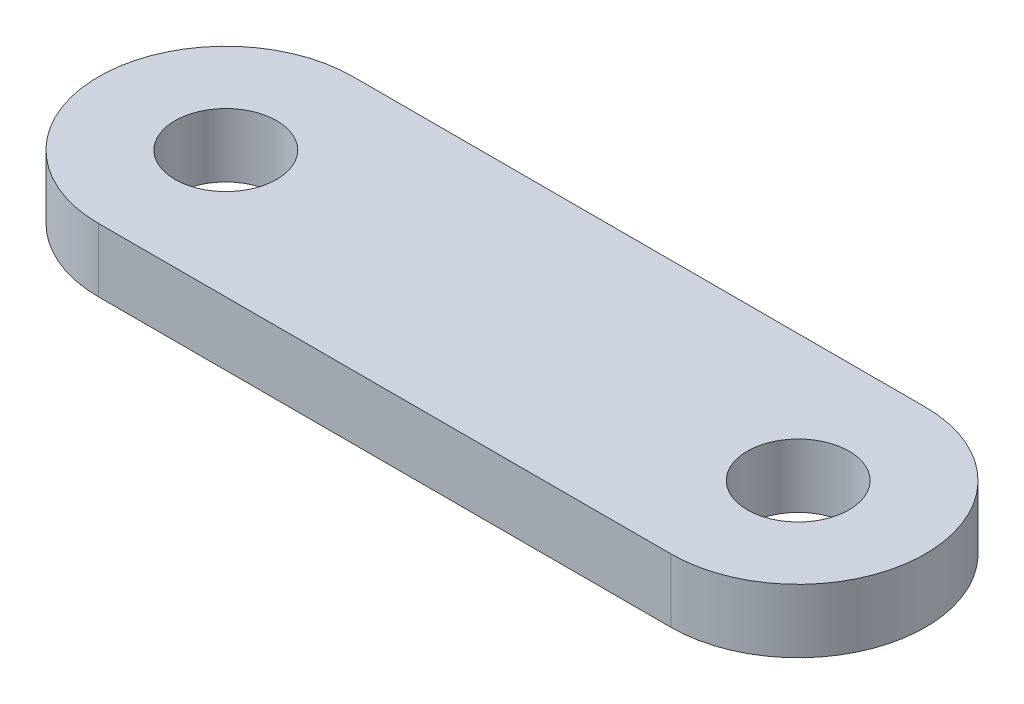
ISO-10303-21;
HEADER;
FILE_DESCRIPTION(('STEP AP214'),'2;1');
FILE_NAME('part.step','',(''),(''),'','','');
FILE_SCHEMA(('AUTOMOTIVE_DESIGN { 1 0 10303 214 1 1 1 1 }'));
ENDSEC;
DATA;
#1=APPLICATION_CONTEXT('core data for automotive mechanical design processes');
#2=APPLICATION_PROTOCOL_DEFINITION('international standard','automotive_design',2000,#1);
#3=PRODUCT_CONTEXT('',#1,'mechanical');
#4=PRODUCT('Part','Part','',(#3));
#5=PRODUCT_RELATED_PRODUCT_CATEGORY('part','',(#4));
#6=PRODUCT_DEFINITION_FORMATION('','',#4);
#7=PRODUCT_DEFINITION_CONTEXT('part definition',#1,'design');
#8=PRODUCT_DEFINITION('design','',#6,#7);
#9=PRODUCT_DEFINITION_SHAPE('','',#8);
#10=(LENGTH_UNIT() NAMED_UNIT(*) SI_UNIT(.MILLI.,.METRE.));
#11=(NAMED_UNIT(*) PLANE_ANGLE_UNIT() SI_UNIT($,.RADIAN.));
#12=(NAMED_UNIT(*) SI_UNIT($,.STERADIAN.) SOLID_ANGLE_UNIT());
#13=UNCERTAINTY_MEASURE_WITH_UNIT(LENGTH_MEASURE(1.E-05),#10,'distance_accuracy_value','');
#14=(GEOMETRIC_REPRESENTATION_CONTEXT(3) GLOBAL_UNCERTAINTY_ASSIGNED_CONTEXT((#13)) GLOBAL_UNIT_ASSIGNED_CONTEXT((#10,
#11,#12)) REPRESENTATION_CONTEXT('',''));
#15=CARTESIAN_POINT('',(0.,0.,0.));
#16=DIRECTION('',(0.,0.,1.));
#17=DIRECTION('',(1.,0.,0.));
#18=AXIS2_PLACEMENT_3D('',#15,#16,#17);
#19=CARTESIAN_POINT('',(0.,2.,4.));
#20=DIRECTION('',(0.,1.,0.));
#21=DIRECTION('',(0.,0.,1.));
#22=AXIS2_PLACEMENT_3D('',#19,#20,#21);
#23=PLANE('',#22);
#24=CARTESIAN_POINT('',(0.,2.,4.));
#25=DIRECTION('',(0.,1.,0.));
#26=DIRECTION('',(0.,0.,1.));
#27=AXIS2_PLACEMENT_3D('',#24,#25,#26);
#28=CIRCLE('',#27,1.6);
#29=CARTESIAN_POINT('',(0.,2.,5.6));
#30=VERTEX_POINT('',#29);
#31=EDGE_CURVE('E101',#30,#30,#28,.T.);
#32=ORIENTED_EDGE('',*,*,#31,.F.);
#33=EDGE_LOOP('',(#32));
#34=FACE_BOUND('',#33,.T.);
#35=CARTESIAN_POINT('',(0.,2.,4.));
#36=DIRECTION('',(0.,1.,0.));
#37=DIRECTION('',(0.,0.,1.));
#38=AXIS2_PLACEMENT_3D('',#35,#36,#37);
#39=CIRCLE('',#38,4.);
#40=CARTESIAN_POINT('',(0.,2.,0.));
#41=VERTEX_POINT('',#40);
#42=CARTESIAN_POINT('',(0.,2.,8.));
#43=VERTEX_POINT('',#42);
#44=EDGE_CURVE('E86',#41,#43,#39,.T.);
#45=ORIENTED_EDGE('',*,*,#44,.T.);
#46=DIRECTION('',(1.,0.,0.));
#47=VECTOR('',#46,1.);
#48=CARTESIAN_POINT('',(0.,2.,8.));
#49=LINE('',#48,#47);
#50=CARTESIAN_POINT('',(18.,2.,8.));
#51=VERTEX_POINT('',#50);
#52=EDGE_CURVE('E81',#43,#51,#49,.T.);
#53=ORIENTED_EDGE('',*,*,#52,.T.);
#54=CARTESIAN_POINT('',(18.,2.,4.));
#55=DIRECTION('',(0.,1.,0.));
#56=DIRECTION('',(0.,0.,-1.));
#57=AXIS2_PLACEMENT_3D('',#54,#55,#56);
#58=CIRCLE('',#57,4.);
#59=CARTESIAN_POINT('',(18.,2.,0.));
#60=VERTEX_POINT('',#59);
#61=EDGE_CURVE('E84',#51,#60,#58,.T.);
#62=ORIENTED_EDGE('',*,*,#61,.T.);
#63=DIRECTION('',(-1.,0.,0.));
#64=VECTOR('',#63,1.);
#65=CARTESIAN_POINT('',(0.,2.,0.));
#66=LINE('',#65,#64);
#67=EDGE_CURVE('E51',#60,#41,#66,.T.);
#68=ORIENTED_EDGE('',*,*,#67,.T.);
#69=EDGE_LOOP('',(#45,#53,#62,#68));
#70=FACE_BOUND('',#69,.T.);
#71=CARTESIAN_POINT('',(18.,2.,4.));
#72=DIRECTION('',(0.,1.,0.));
#73=DIRECTION('',(0.,0.,1.));
#74=AXIS2_PLACEMENT_3D('',#71,#72,#73);
#75=CIRCLE('',#74,1.6);
#76=CARTESIAN_POINT('',(18.,2.,5.6));
#77=VERTEX_POINT('',#76);
#78=EDGE_CURVE('E116',#77,#77,#75,.T.);
#79=ORIENTED_EDGE('',*,*,#78,.F.);
#80=EDGE_LOOP('',(#79));
#81=FACE_BOUND('',#80,.T.);
#82=ADVANCED_FACE('F34',(#34,#70,#81),#23,.T.);
#83=CARTESIAN_POINT('',(0.,0.,4.));
#84=DIRECTION('',(0.,1.,0.));
#85=DIRECTION('',(0.,0.,1.));
#86=AXIS2_PLACEMENT_3D('',#83,#84,#85);
#87=PLANE('',#86);
#88=CARTESIAN_POINT('',(0.,0.,4.));
#89=DIRECTION('',(0.,1.,0.));
#90=DIRECTION('',(0.,0.,1.));
#91=AXIS2_PLACEMENT_3D('',#88,#89,#90);
#92=CIRCLE('',#91,4.);
#93=CARTESIAN_POINT('',(0.,0.,0.));
#94=VERTEX_POINT('',#93);
#95=CARTESIAN_POINT('',(0.,0.,8.));
#96=VERTEX_POINT('',#95);
#97=EDGE_CURVE('E98',#94,#96,#92,.T.);
#98=ORIENTED_EDGE('',*,*,#97,.F.);
#99=DIRECTION('',(-1.,0.,0.));
#100=VECTOR('',#99,1.);
#101=CARTESIAN_POINT('',(0.,0.,0.));
#102=LINE('',#101,#100);
#103=CARTESIAN_POINT('',(18.,0.,0.));
#104=VERTEX_POINT('',#103);
#105=EDGE_CURVE('E74',#104,#94,#102,.T.);
#106=ORIENTED_EDGE('',*,*,#105,.F.);
#107=CARTESIAN_POINT('',(18.,0.,4.));
#108=DIRECTION('',(0.,1.,0.));
#109=DIRECTION('',(0.,0.,-1.));
#110=AXIS2_PLACEMENT_3D('',#107,#108,#109);
#111=CIRCLE('',#110,4.);
#112=CARTESIAN_POINT('',(18.,0.,8.));
#113=VERTEX_POINT('',#112);
#114=EDGE_CURVE('E68',#113,#104,#111,.T.);
#115=ORIENTED_EDGE('',*,*,#114,.F.);
#116=DIRECTION('',(1.,0.,0.));
#117=VECTOR('',#116,1.);
#118=CARTESIAN_POINT('',(0.,0.,8.));
#119=LINE('',#118,#117);
#120=EDGE_CURVE('E90',#96,#113,#119,.T.);
#121=ORIENTED_EDGE('',*,*,#120,.F.);
#122=EDGE_LOOP('',(#98,#106,#115,#121));
#123=FACE_BOUND('',#122,.T.);
#124=CARTESIAN_POINT('',(0.,0.,4.));
#125=DIRECTION('',(0.,1.,0.));
#126=DIRECTION('',(0.,0.,1.));
#127=AXIS2_PLACEMENT_3D('',#124,#125,#126);
#128=CIRCLE('',#127,1.6);
#129=CARTESIAN_POINT('',(0.,0.,5.6));
#130=VERTEX_POINT('',#129);
#131=EDGE_CURVE('E113',#130,#130,#128,.T.);
#132=ORIENTED_EDGE('',*,*,#131,.T.);
#133=EDGE_LOOP('',(#132));
#134=FACE_BOUND('',#133,.T.);
#135=CARTESIAN_POINT('',(18.,0.,4.));
#136=DIRECTION('',(0.,1.,0.));
#137=DIRECTION('',(0.,0.,1.));
#138=AXIS2_PLACEMENT_3D('',#135,#136,#137);
#139=CIRCLE('',#138,1.6);
#140=CARTESIAN_POINT('',(18.,0.,5.6));
#141=VERTEX_POINT('',#140);
#142=EDGE_CURVE('E119',#141,#141,#139,.T.);
#143=ORIENTED_EDGE('',*,*,#142,.T.);
#144=EDGE_LOOP('',(#143));
#145=FACE_BOUND('',#144,.T.);
#146=ADVANCED_FACE('F109',(#123,#134,#145),#87,.F.);
#147=CARTESIAN_POINT('',(0.,2.,4.));
#148=DIRECTION('',(0.,-1.,0.));
#149=DIRECTION('',(0.,0.,-1.));
#150=AXIS2_PLACEMENT_3D('',#147,#148,#149);
#151=CYLINDRICAL_SURFACE('',#150,4.);
#152=ORIENTED_EDGE('',*,*,#97,.T.);
#153=DIRECTION('',(0.,-1.,0.));
#154=VECTOR('',#153,1.);
#155=CARTESIAN_POINT('',(0.,2.,8.));
#156=LINE('',#155,#154);
#157=EDGE_CURVE('E11',#43,#96,#156,.T.);
#158=ORIENTED_EDGE('',*,*,#157,.F.);
#159=ORIENTED_EDGE('',*,*,#44,.F.);
#160=DIRECTION('',(0.,-1.,0.));
#161=VECTOR('',#160,1.);
#162=CARTESIAN_POINT('',(0.,2.,0.));
#163=LINE('',#162,#161);
#164=EDGE_CURVE('E94',#41,#94,#163,.T.);
#165=ORIENTED_EDGE('',*,*,#164,.T.);
#166=EDGE_LOOP('',(#152,#158,#159,#165));
#167=FACE_BOUND('',#166,.T.);
#168=ADVANCED_FACE('F36',(#167),#151,.T.);
#169=CARTESIAN_POINT('',(0.,2.,8.));
#170=DIRECTION('',(0.,0.,-1.));
#171=DIRECTION('',(-1.,0.,0.));
#172=AXIS2_PLACEMENT_3D('',#169,#170,#171);
#173=PLANE('',#172);
#174=ORIENTED_EDGE('',*,*,#120,.T.);
#175=DIRECTION('',(0.,-1.,0.));
#176=VECTOR('',#175,1.);
#177=CARTESIAN_POINT('',(18.,2.,8.));
#178=LINE('',#177,#176);
#179=EDGE_CURVE('E43',#51,#113,#178,.T.);
#180=ORIENTED_EDGE('',*,*,#179,.F.);
#181=ORIENTED_EDGE('',*,*,#52,.F.);
#182=ORIENTED_EDGE('',*,*,#157,.T.);
#183=EDGE_LOOP('',(#174,#180,#181,#182));
#184=FACE_BOUND('',#183,.T.);
#185=ADVANCED_FACE('F89',(#184),#173,.F.);
#186=CARTESIAN_POINT('',(18.,2.,4.));
#187=DIRECTION('',(0.,-1.,0.));
#188=DIRECTION('',(0.,0.,-1.));
#189=AXIS2_PLACEMENT_3D('',#186,#187,#188);
#190=CYLINDRICAL_SURFACE('',#189,4.);
#191=ORIENTED_EDGE('',*,*,#114,.T.);
#192=DIRECTION('',(0.,-1.,0.));
#193=VECTOR('',#192,1.);
#194=CARTESIAN_POINT('',(18.,2.,0.));
#195=LINE('',#194,#193);
#196=EDGE_CURVE('E91',#60,#104,#195,.T.);
#197=ORIENTED_EDGE('',*,*,#196,.F.);
#198=ORIENTED_EDGE('',*,*,#61,.F.);
#199=ORIENTED_EDGE('',*,*,#179,.T.);
#200=EDGE_LOOP('',(#191,#197,#198,#199));
#201=FACE_BOUND('',#200,.T.);
#202=ADVANCED_FACE('F92',(#201),#190,.T.);
#203=CARTESIAN_POINT('',(0.,2.,0.));
#204=DIRECTION('',(0.,0.,1.));
#205=DIRECTION('',(1.,0.,0.));
#206=AXIS2_PLACEMENT_3D('',#203,#204,#205);
#207=PLANE('',#206);
#208=ORIENTED_EDGE('',*,*,#105,.T.);
#209=ORIENTED_EDGE('',*,*,#164,.F.);
#210=ORIENTED_EDGE('',*,*,#67,.F.);
#211=ORIENTED_EDGE('',*,*,#196,.T.);
#212=EDGE_LOOP('',(#208,#209,#210,#211));
#213=FACE_BOUND('',#212,.T.);
#214=ADVANCED_FACE('F106',(#213),#207,.F.);
#215=CARTESIAN_POINT('',(0.,2.,4.));
#216=DIRECTION('',(0.,-1.,0.));
#217=DIRECTION('',(0.,0.,-1.));
#218=AXIS2_PLACEMENT_3D('',#215,#216,#217);
#219=CYLINDRICAL_SURFACE('',#218,1.6);
#220=ORIENTED_EDGE('',*,*,#31,.T.);
#221=EDGE_LOOP('',(#220));
#222=FACE_BOUND('',#221,.T.);
#223=ORIENTED_EDGE('',*,*,#131,.F.);
#224=EDGE_LOOP('',(#223));
#225=FACE_BOUND('',#224,.T.);
#226=ADVANCED_FACE('F136',(#222,#225),#219,.F.);
#227=CARTESIAN_POINT('',(18.,2.,4.));
#228=DIRECTION('',(0.,-1.,0.));
#229=DIRECTION('',(0.,0.,-1.));
#230=AXIS2_PLACEMENT_3D('',#227,#228,#229);
#231=CYLINDRICAL_SURFACE('',#230,1.6);
#232=ORIENTED_EDGE('',*,*,#78,.T.);
#233=EDGE_LOOP('',(#232));
#234=FACE_BOUND('',#233,.T.);
#235=ORIENTED_EDGE('',*,*,#142,.F.);
#236=EDGE_LOOP('',(#235));
#237=FACE_BOUND('',#236,.T.);
#238=ADVANCED_FACE('F125',(#234,#237),#231,.F.);
#239=CLOSED_SHELL('',(#82,#146,#168,#185,#202,#214,#226,#238));
#240=MANIFOLD_SOLID_BREP('B2',#239);
#241=ADVANCED_BREP_SHAPE_REPRESENTATION('',(#18,#240),#14);
#242=SHAPE_DEFINITION_REPRESENTATION(#9,#241);
ENDSEC;
END-ISO-10303-21;
